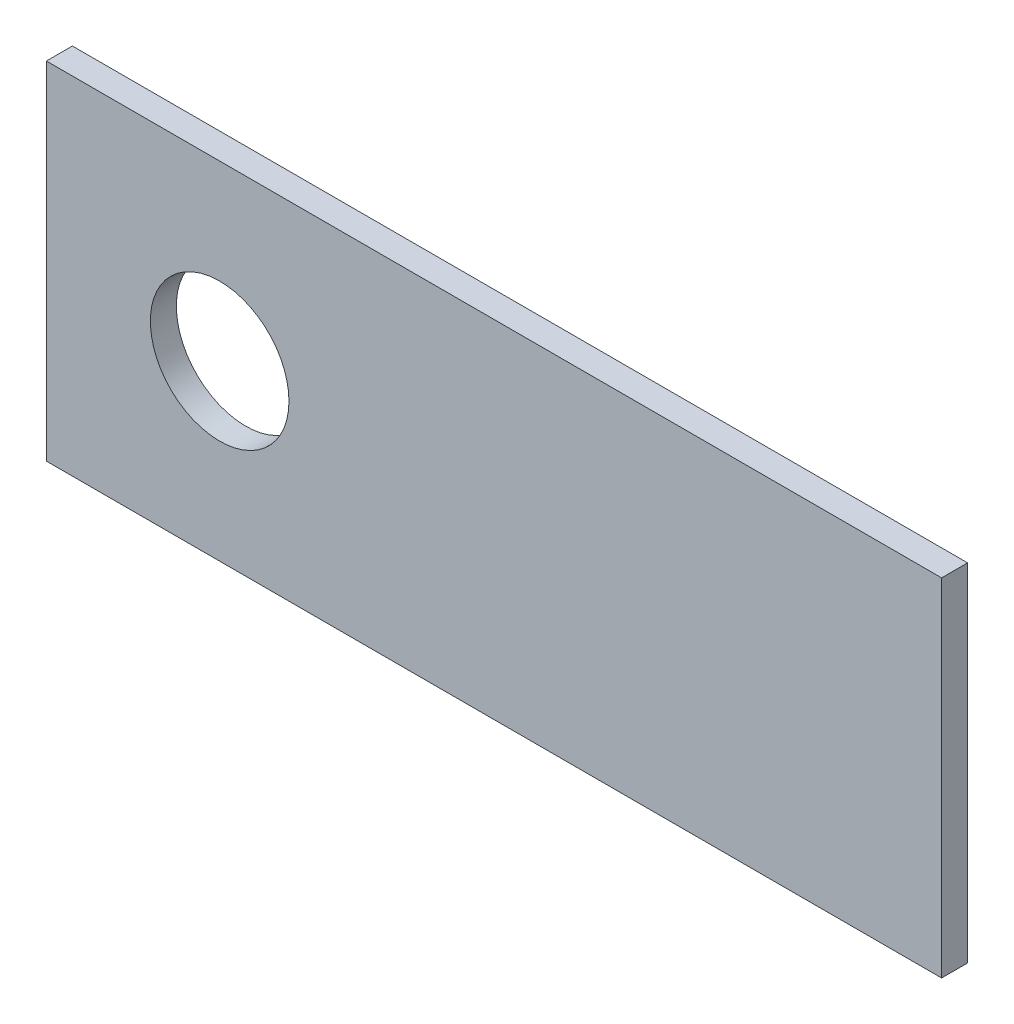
ISO-10303-21;
HEADER;
FILE_DESCRIPTION(('STEP AP214'),'2;1');
FILE_NAME('part.step','',(''),(''),'','','');
FILE_SCHEMA(('AUTOMOTIVE_DESIGN { 1 0 10303 214 1 1 1 1 }'));
ENDSEC;
DATA;
#1=APPLICATION_CONTEXT('core data for automotive mechanical design processes');
#2=APPLICATION_PROTOCOL_DEFINITION('international standard','automotive_design',2000,#1);
#3=PRODUCT_CONTEXT('',#1,'mechanical');
#4=PRODUCT('Part','Part','',(#3));
#5=PRODUCT_RELATED_PRODUCT_CATEGORY('part','',(#4));
#6=PRODUCT_DEFINITION_FORMATION('','',#4);
#7=PRODUCT_DEFINITION_CONTEXT('part definition',#1,'design');
#8=PRODUCT_DEFINITION('design','',#6,#7);
#9=PRODUCT_DEFINITION_SHAPE('','',#8);
#10=(LENGTH_UNIT() NAMED_UNIT(*) SI_UNIT(.MILLI.,.METRE.));
#11=(NAMED_UNIT(*) PLANE_ANGLE_UNIT() SI_UNIT($,.RADIAN.));
#12=(NAMED_UNIT(*) SI_UNIT($,.STERADIAN.) SOLID_ANGLE_UNIT());
#13=UNCERTAINTY_MEASURE_WITH_UNIT(LENGTH_MEASURE(1.E-05),#10,'distance_accuracy_value','');
#14=(GEOMETRIC_REPRESENTATION_CONTEXT(3) GLOBAL_UNCERTAINTY_ASSIGNED_CONTEXT((#13)) GLOBAL_UNIT_ASSIGNED_CONTEXT((#10,
#11,#12)) REPRESENTATION_CONTEXT('',''));
#15=CARTESIAN_POINT('',(0.,0.,0.));
#16=DIRECTION('',(0.,0.,1.));
#17=DIRECTION('',(1.,0.,0.));
#18=AXIS2_PLACEMENT_3D('',#15,#16,#17);
#19=CARTESIAN_POINT('',(-77.5,-30.,4.5));
#20=DIRECTION('',(1.,0.,0.));
#21=DIRECTION('',(0.,0.,-1.));
#22=AXIS2_PLACEMENT_3D('',#19,#20,#21);
#23=PLANE('',#22);
#24=DIRECTION('',(0.,-1.,0.));
#25=VECTOR('',#24,1.);
#26=CARTESIAN_POINT('',(-77.5,-30.,0.));
#27=LINE('',#26,#25);
#28=CARTESIAN_POINT('',(-77.5,30.,0.));
#29=VERTEX_POINT('',#28);
#30=CARTESIAN_POINT('',(-77.5,-30.,0.));
#31=VERTEX_POINT('',#30);
#32=EDGE_CURVE('E122',#29,#31,#27,.T.);
#33=ORIENTED_EDGE('',*,*,#32,.T.);
#34=DIRECTION('',(0.,0.,-1.));
#35=VECTOR('',#34,1.);
#36=CARTESIAN_POINT('',(-77.5,-30.,4.5));
#37=LINE('',#36,#35);
#38=CARTESIAN_POINT('',(-77.5,-30.,4.5));
#39=VERTEX_POINT('',#38);
#40=EDGE_CURVE('E12',#39,#31,#37,.T.);
#41=ORIENTED_EDGE('',*,*,#40,.F.);
#42=DIRECTION('',(0.,-1.,0.));
#43=VECTOR('',#42,1.);
#44=CARTESIAN_POINT('',(-77.5,-30.,4.5));
#45=LINE('',#44,#43);
#46=CARTESIAN_POINT('',(-77.5,30.,4.5));
#47=VERTEX_POINT('',#46);
#48=EDGE_CURVE('E91',#47,#39,#45,.T.);
#49=ORIENTED_EDGE('',*,*,#48,.F.);
#50=DIRECTION('',(0.,0.,-1.));
#51=VECTOR('',#50,1.);
#52=CARTESIAN_POINT('',(-77.5,30.,4.5));
#53=LINE('',#52,#51);
#54=EDGE_CURVE('E103',#47,#29,#53,.T.);
#55=ORIENTED_EDGE('',*,*,#54,.T.);
#56=EDGE_LOOP('',(#33,#41,#49,#55));
#57=FACE_BOUND('',#56,.T.);
#58=ADVANCED_FACE('F39',(#57),#23,.F.);
#59=CARTESIAN_POINT('',(77.5,-30.,4.5));
#60=DIRECTION('',(0.,1.,0.));
#61=DIRECTION('',(-1.,0.,0.));
#62=AXIS2_PLACEMENT_3D('',#59,#60,#61);
#63=PLANE('',#62);
#64=DIRECTION('',(1.,0.,0.));
#65=VECTOR('',#64,1.);
#66=CARTESIAN_POINT('',(77.5,-30.,0.));
#67=LINE('',#66,#65);
#68=CARTESIAN_POINT('',(77.5,-30.,0.));
#69=VERTEX_POINT('',#68);
#70=EDGE_CURVE('E96',#31,#69,#67,.T.);
#71=ORIENTED_EDGE('',*,*,#70,.T.);
#72=DIRECTION('',(0.,0.,-1.));
#73=VECTOR('',#72,1.);
#74=CARTESIAN_POINT('',(77.5,-30.,4.5));
#75=LINE('',#74,#73);
#76=CARTESIAN_POINT('',(77.5,-30.,4.5));
#77=VERTEX_POINT('',#76);
#78=EDGE_CURVE('E48',#77,#69,#75,.T.);
#79=ORIENTED_EDGE('',*,*,#78,.F.);
#80=DIRECTION('',(1.,0.,0.));
#81=VECTOR('',#80,1.);
#82=CARTESIAN_POINT('',(77.5,-30.,4.5));
#83=LINE('',#82,#81);
#84=EDGE_CURVE('E86',#39,#77,#83,.T.);
#85=ORIENTED_EDGE('',*,*,#84,.F.);
#86=ORIENTED_EDGE('',*,*,#40,.T.);
#87=EDGE_LOOP('',(#71,#79,#85,#86));
#88=FACE_BOUND('',#87,.T.);
#89=ADVANCED_FACE('F95',(#88),#63,.F.);
#90=CARTESIAN_POINT('',(77.5,-30.,4.5));
#91=DIRECTION('',(-1.,0.,0.));
#92=DIRECTION('',(0.,0.,1.));
#93=AXIS2_PLACEMENT_3D('',#90,#91,#92);
#94=PLANE('',#93);
#95=DIRECTION('',(0.,1.,0.));
#96=VECTOR('',#95,1.);
#97=CARTESIAN_POINT('',(77.5,-30.,0.));
#98=LINE('',#97,#96);
#99=CARTESIAN_POINT('',(77.5,30.,0.));
#100=VERTEX_POINT('',#99);
#101=EDGE_CURVE('E73',#69,#100,#98,.T.);
#102=ORIENTED_EDGE('',*,*,#101,.T.);
#103=DIRECTION('',(0.,0.,-1.));
#104=VECTOR('',#103,1.);
#105=CARTESIAN_POINT('',(77.5,30.,4.5));
#106=LINE('',#105,#104);
#107=CARTESIAN_POINT('',(77.5,30.,4.5));
#108=VERTEX_POINT('',#107);
#109=EDGE_CURVE('E97',#108,#100,#106,.T.);
#110=ORIENTED_EDGE('',*,*,#109,.F.);
#111=DIRECTION('',(0.,1.,0.));
#112=VECTOR('',#111,1.);
#113=CARTESIAN_POINT('',(77.5,-30.,4.5));
#114=LINE('',#113,#112);
#115=EDGE_CURVE('E89',#77,#108,#114,.T.);
#116=ORIENTED_EDGE('',*,*,#115,.F.);
#117=ORIENTED_EDGE('',*,*,#78,.T.);
#118=EDGE_LOOP('',(#102,#110,#116,#117));
#119=FACE_BOUND('',#118,.T.);
#120=ADVANCED_FACE('F99',(#119),#94,.F.);
#121=CARTESIAN_POINT('',(77.5,30.,4.5));
#122=DIRECTION('',(0.,-1.,0.));
#123=DIRECTION('',(1.,0.,0.));
#124=AXIS2_PLACEMENT_3D('',#121,#122,#123);
#125=PLANE('',#124);
#126=DIRECTION('',(-1.,0.,0.));
#127=VECTOR('',#126,1.);
#128=CARTESIAN_POINT('',(77.5,30.,0.));
#129=LINE('',#128,#127);
#130=EDGE_CURVE('E79',#100,#29,#129,.T.);
#131=ORIENTED_EDGE('',*,*,#130,.T.);
#132=ORIENTED_EDGE('',*,*,#54,.F.);
#133=DIRECTION('',(-1.,0.,0.));
#134=VECTOR('',#133,1.);
#135=CARTESIAN_POINT('',(77.5,30.,4.5));
#136=LINE('',#135,#134);
#137=EDGE_CURVE('E56',#108,#47,#136,.T.);
#138=ORIENTED_EDGE('',*,*,#137,.F.);
#139=ORIENTED_EDGE('',*,*,#109,.T.);
#140=EDGE_LOOP('',(#131,#132,#138,#139));
#141=FACE_BOUND('',#140,.T.);
#142=ADVANCED_FACE('F133',(#141),#125,.F.);
#143=CARTESIAN_POINT('',(0.,0.,4.5));
#144=DIRECTION('',(0.,0.,1.));
#145=DIRECTION('',(1.,0.,0.));
#146=AXIS2_PLACEMENT_3D('',#143,#144,#145);
#147=PLANE('',#146);
#148=CARTESIAN_POINT('',(-47.5,0.,4.5));
#149=DIRECTION('',(0.,0.,1.));
#150=DIRECTION('',(1.,0.,0.));
#151=AXIS2_PLACEMENT_3D('',#148,#149,#150);
#152=CIRCLE('',#151,12.);
#153=CARTESIAN_POINT('',(-35.5,0.,4.5));
#154=VERTEX_POINT('',#153);
#155=EDGE_CURVE('E115',#154,#154,#152,.T.);
#156=ORIENTED_EDGE('',*,*,#155,.F.);
#157=EDGE_LOOP('',(#156));
#158=FACE_BOUND('',#157,.T.);
#159=ORIENTED_EDGE('',*,*,#48,.T.);
#160=ORIENTED_EDGE('',*,*,#84,.T.);
#161=ORIENTED_EDGE('',*,*,#115,.T.);
#162=ORIENTED_EDGE('',*,*,#137,.T.);
#163=EDGE_LOOP('',(#159,#160,#161,#162));
#164=FACE_BOUND('',#163,.T.);
#165=ADVANCED_FACE('F87',(#158,#164),#147,.T.);
#166=CARTESIAN_POINT('',(0.,0.,0.));
#167=DIRECTION('',(0.,0.,1.));
#168=DIRECTION('',(1.,0.,0.));
#169=AXIS2_PLACEMENT_3D('',#166,#167,#168);
#170=PLANE('',#169);
#171=CARTESIAN_POINT('',(-47.5,0.,0.));
#172=DIRECTION('',(0.,0.,1.));
#173=DIRECTION('',(1.,0.,0.));
#174=AXIS2_PLACEMENT_3D('',#171,#172,#173);
#175=CIRCLE('',#174,12.);
#176=CARTESIAN_POINT('',(-35.5,0.,0.));
#177=VERTEX_POINT('',#176);
#178=EDGE_CURVE('E42',#177,#177,#175,.T.);
#179=ORIENTED_EDGE('',*,*,#178,.T.);
#180=EDGE_LOOP('',(#179));
#181=FACE_BOUND('',#180,.T.);
#182=ORIENTED_EDGE('',*,*,#32,.F.);
#183=ORIENTED_EDGE('',*,*,#130,.F.);
#184=ORIENTED_EDGE('',*,*,#101,.F.);
#185=ORIENTED_EDGE('',*,*,#70,.F.);
#186=EDGE_LOOP('',(#182,#183,#184,#185));
#187=FACE_BOUND('',#186,.T.);
#188=ADVANCED_FACE('F135',(#181,#187),#170,.F.);
#189=CARTESIAN_POINT('',(-47.5,0.,-5.5));
#190=DIRECTION('',(0.,0.,1.));
#191=DIRECTION('',(1.,0.,0.));
#192=AXIS2_PLACEMENT_3D('',#189,#190,#191);
#193=CYLINDRICAL_SURFACE('',#192,12.);
#194=ORIENTED_EDGE('',*,*,#155,.T.);
#195=EDGE_LOOP('',(#194));
#196=FACE_BOUND('',#195,.T.);
#197=ORIENTED_EDGE('',*,*,#178,.F.);
#198=EDGE_LOOP('',(#197));
#199=FACE_BOUND('',#198,.T.);
#200=ADVANCED_FACE('F149',(#196,#199),#193,.F.);
#201=CLOSED_SHELL('',(#58,#89,#120,#142,#165,#188,#200));
#202=MANIFOLD_SOLID_BREP('B2',#201);
#203=ADVANCED_BREP_SHAPE_REPRESENTATION('',(#18,#202),#14);
#204=SHAPE_DEFINITION_REPRESENTATION(#9,#203);
ENDSEC;
END-ISO-10303-21;
